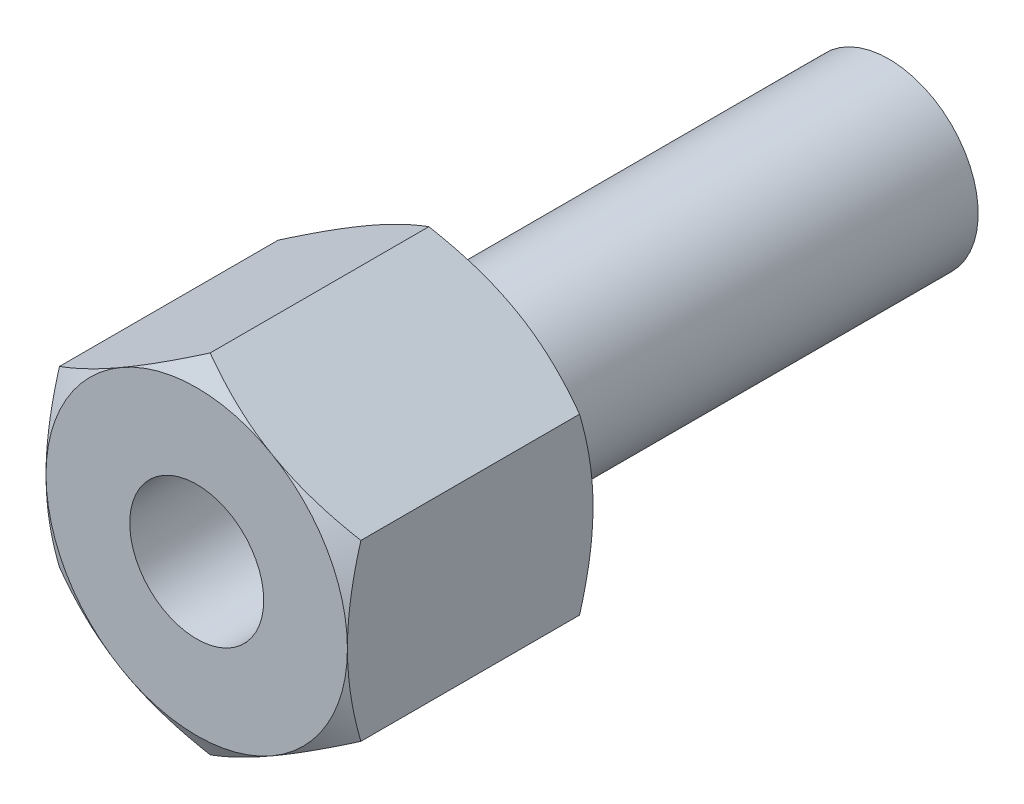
ISO-10303-21;
HEADER;
FILE_DESCRIPTION(('STEP AP214'),'2;1');
FILE_NAME('part.step','',(''),(''),'','','');
FILE_SCHEMA(('AUTOMOTIVE_DESIGN { 1 0 10303 214 1 1 1 1 }'));
ENDSEC;
DATA;
#1=APPLICATION_CONTEXT('core data for automotive mechanical design processes');
#2=APPLICATION_PROTOCOL_DEFINITION('international standard','automotive_design',2000,#1);
#3=PRODUCT_CONTEXT('',#1,'mechanical');
#4=PRODUCT('Part','Part','',(#3));
#5=PRODUCT_RELATED_PRODUCT_CATEGORY('part','',(#4));
#6=PRODUCT_DEFINITION_FORMATION('','',#4);
#7=PRODUCT_DEFINITION_CONTEXT('part definition',#1,'design');
#8=PRODUCT_DEFINITION('design','',#6,#7);
#9=PRODUCT_DEFINITION_SHAPE('','',#8);
#10=(LENGTH_UNIT() NAMED_UNIT(*) SI_UNIT(.MILLI.,.METRE.));
#11=(NAMED_UNIT(*) PLANE_ANGLE_UNIT() SI_UNIT($,.RADIAN.));
#12=(NAMED_UNIT(*) SI_UNIT($,.STERADIAN.) SOLID_ANGLE_UNIT());
#13=UNCERTAINTY_MEASURE_WITH_UNIT(LENGTH_MEASURE(1.E-05),#10,'distance_accuracy_value','');
#14=(GEOMETRIC_REPRESENTATION_CONTEXT(3) GLOBAL_UNCERTAINTY_ASSIGNED_CONTEXT((#13)) GLOBAL_UNIT_ASSIGNED_CONTEXT((#10,
#11,#12)) REPRESENTATION_CONTEXT('',''));
#15=CARTESIAN_POINT('',(0.,0.,0.));
#16=DIRECTION('',(0.,0.,1.));
#17=DIRECTION('',(1.,0.,0.));
#18=AXIS2_PLACEMENT_3D('',#15,#16,#17);
#19=CARTESIAN_POINT('',(0.,15.5884572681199,22.));
#20=DIRECTION('',(0.5,-0.866025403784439,0.));
#21=DIRECTION('',(0.866025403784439,0.5,0.));
#22=AXIS2_PLACEMENT_3D('',#19,#20,#21);
#23=PLANE('',#22);
#24=CARTESIAN_POINT('',(-13.5002,7.79411316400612,1.20583803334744));
#25=CARTESIAN_POINT('',(-13.2034751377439,7.96542734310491,1.10693600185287));
#26=CARTESIAN_POINT('',(-12.9055928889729,8.13740973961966,1.01252193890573));
#27=CARTESIAN_POINT('',(-12.3074397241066,8.48275363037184,0.833917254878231));
#28=CARTESIAN_POINT('',(-12.0071680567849,8.65611555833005,0.749729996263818));
#29=CARTESIAN_POINT('',(-11.403655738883,9.00455355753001,0.592710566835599));
#30=CARTESIAN_POINT('',(-11.1004098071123,9.17963267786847,0.519905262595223));
#31=CARTESIAN_POINT('',(-10.4918107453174,9.53100751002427,0.387213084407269));
#32=CARTESIAN_POINT('',(-10.1864577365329,9.70730315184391,0.327325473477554));
#33=CARTESIAN_POINT('',(-9.58146884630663,10.0565936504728,0.223015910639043));
#34=CARTESIAN_POINT('',(-9.28187788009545,10.2295625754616,0.17824871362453));
#35=CARTESIAN_POINT('',(-8.68132315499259,10.5762930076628,0.103183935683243));
#36=CARTESIAN_POINT('',(-8.38035936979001,10.7500545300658,0.0728866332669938));
#37=CARTESIAN_POINT('',(-7.77792621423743,11.0978694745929,0.0275266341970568));
#38=CARTESIAN_POINT('',(-7.47645787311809,11.2719223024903,0.012445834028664));
#39=CARTESIAN_POINT('',(-6.87324289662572,11.6201886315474,-0.00215683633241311));
#40=CARTESIAN_POINT('',(-6.57149627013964,11.7944021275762,-0.00167918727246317));
#41=CARTESIAN_POINT('',(-6.00738189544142,12.1200937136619,0.0137483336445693));
#42=CARTESIAN_POINT('',(-5.74497394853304,12.271595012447,0.0268164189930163));
#43=CARTESIAN_POINT('',(-5.22076165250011,12.5742491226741,0.0644725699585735));
#44=CARTESIAN_POINT('',(-4.95895734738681,12.7254019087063,0.0890614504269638));
#45=CARTESIAN_POINT('',(-4.43609453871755,13.0272768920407,0.149330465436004));
#46=CARTESIAN_POINT('',(-4.17503683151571,13.1779986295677,0.185019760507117));
#47=CARTESIAN_POINT('',(-3.65414530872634,13.4787354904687,0.266863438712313));
#48=CARTESIAN_POINT('',(-3.39431157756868,13.6287505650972,0.313018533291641));
#49=CARTESIAN_POINT('',(-2.60557180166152,14.0841296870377,0.468349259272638));
#50=CARTESIAN_POINT('',(-2.07894982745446,14.3881750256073,0.593013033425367));
#51=CARTESIAN_POINT('',(-1.03355849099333,14.9917319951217,0.875948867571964));
#52=CARTESIAN_POINT('',(-0.514775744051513,15.2912513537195,1.03415447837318));
#53=CARTESIAN_POINT('',(0.000200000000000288,15.5885727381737,1.20583803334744));
#54=B_SPLINE_CURVE_WITH_KNOTS('',3,(#24,#25,#26,#27,#28,#29,#30,#31,#32,#33,#34,#35,#36,#37,#38,
#39,#40,#41,#42,#43,#44,#45,#46,#47,#48,#49,#50,#51,#52,#53),.UNSPECIFIED.,.F.,.F.,(4,2,2,2,2,2,
2,2,2,2,2,2,2,2,4),(0.,1.0698794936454,2.14010980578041,3.21282939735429,4.28548777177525,
5.33167033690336,6.37787303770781,7.42282956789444,8.46775380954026,9.377387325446,
10.2870851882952,11.1975357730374,12.1080482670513,13.9691139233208,15.8265265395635),.UNSPECIFIED.);
#55=CARTESIAN_POINT('',(-13.5,7.79422863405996,1.20577136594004));
#56=VERTEX_POINT('',#55);
#57=CARTESIAN_POINT('',(-6.75,11.6913429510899,0.));
#58=VERTEX_POINT('',#57);
#59=EDGE_CURVE('E135',#56,#58,#54,.T.);
#60=ORIENTED_EDGE('',*,*,#59,.F.);
#61=DIRECTION('',(0.,0.,-1.));
#62=VECTOR('',#61,1.);
#63=CARTESIAN_POINT('',(-13.5,7.79422863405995,22.));
#64=LINE('',#63,#62);
#65=CARTESIAN_POINT('',(-13.5,7.79422863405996,20.79422863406));
#66=VERTEX_POINT('',#65);
#67=EDGE_CURVE('E262',#66,#56,#64,.T.);
#68=ORIENTED_EDGE('',*,*,#67,.F.);
#69=CARTESIAN_POINT('',(0.000199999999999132,15.5885727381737,20.7941619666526));
#70=CARTESIAN_POINT('',(-0.296524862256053,15.417258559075,20.8930639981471));
#71=CARTESIAN_POINT('',(-0.59440711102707,15.2452761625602,20.9874780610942));
#72=CARTESIAN_POINT('',(-1.19256027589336,14.899932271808,21.1660827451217));
#73=CARTESIAN_POINT('',(-1.49283194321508,14.7265703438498,21.2502700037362));
#74=CARTESIAN_POINT('',(-2.09634426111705,14.3781323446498,21.4072894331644));
#75=CARTESIAN_POINT('',(-2.39959019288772,14.2030532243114,21.4800947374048));
#76=CARTESIAN_POINT('',(-3.00818925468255,13.8516783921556,21.6127869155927));
#77=CARTESIAN_POINT('',(-3.31354226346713,13.675382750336,21.6726745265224));
#78=CARTESIAN_POINT('',(-3.91853115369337,13.3260922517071,21.7769840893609));
#79=CARTESIAN_POINT('',(-4.21812211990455,13.1531233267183,21.8217512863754));
#80=CARTESIAN_POINT('',(-4.81867684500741,12.8063928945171,21.8968160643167));
#81=CARTESIAN_POINT('',(-5.11964063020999,12.632631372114,21.927113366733));
#82=CARTESIAN_POINT('',(-5.72207378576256,12.284816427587,21.9724733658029));
#83=CARTESIAN_POINT('',(-6.02354212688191,12.1107635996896,21.9875541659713));
#84=CARTESIAN_POINT('',(-6.62675710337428,11.7624972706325,22.0021568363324));
#85=CARTESIAN_POINT('',(-6.92850372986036,11.5882837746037,22.0016791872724));
#86=CARTESIAN_POINT('',(-7.49261810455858,11.262592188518,21.9862516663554));
#87=CARTESIAN_POINT('',(-7.75502605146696,11.1110908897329,21.973183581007));
#88=CARTESIAN_POINT('',(-8.27923834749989,10.8084367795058,21.9355274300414));
#89=CARTESIAN_POINT('',(-8.54104265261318,10.6572839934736,21.910938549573));
#90=CARTESIAN_POINT('',(-9.06390546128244,10.3554090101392,21.850669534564));
#91=CARTESIAN_POINT('',(-9.32496316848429,10.2046872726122,21.8149802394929));
#92=CARTESIAN_POINT('',(-9.84585469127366,9.90395041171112,21.7331365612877));
#93=CARTESIAN_POINT('',(-10.1056884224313,9.7539353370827,21.6869814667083));
#94=CARTESIAN_POINT('',(-10.8944281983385,9.29855621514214,21.5316507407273));
#95=CARTESIAN_POINT('',(-11.4210501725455,8.99451087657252,21.4069869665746));
#96=CARTESIAN_POINT('',(-12.4664415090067,8.39095390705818,21.124051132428));
#97=CARTESIAN_POINT('',(-12.9852242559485,8.09143454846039,20.9658455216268));
#98=CARTESIAN_POINT('',(-13.5002,7.79411316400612,20.7941619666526));
#99=B_SPLINE_CURVE_WITH_KNOTS('',3,(#69,#70,#71,#72,#73,#74,#75,#76,#77,#78,#79,#80,#81,#82,#83,
#84,#85,#86,#87,#88,#89,#90,#91,#92,#93,#94,#95,#96,#97,#98),.UNSPECIFIED.,.F.,.F.,(4,2,2,2,2,2,
2,2,2,2,2,2,2,2,4),(0.,1.0698794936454,2.14010980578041,3.21282939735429,4.28548777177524,
5.33167033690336,6.37787303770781,7.42282956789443,8.46775380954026,9.37738732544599,
10.2870851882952,11.1975357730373,12.1080482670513,13.9691139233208,15.8265265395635),.UNSPECIFIED.);
#100=CARTESIAN_POINT('',(-6.75,11.6913429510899,22.));
#101=VERTEX_POINT('',#100);
#102=EDGE_CURVE('E197',#101,#66,#99,.T.);
#103=ORIENTED_EDGE('',*,*,#102,.F.);
#104=CARTESIAN_POINT('',(0.,15.5884572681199,20.79422863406));
#105=VERTEX_POINT('',#104);
#106=EDGE_CURVE('E225',#105,#101,#99,.T.);
#107=ORIENTED_EDGE('',*,*,#106,.F.);
#108=DIRECTION('',(0.,0.,-1.));
#109=VECTOR('',#108,1.);
#110=CARTESIAN_POINT('',(0.,15.5884572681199,22.));
#111=LINE('',#110,#109);
#112=CARTESIAN_POINT('',(0.,15.5884572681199,1.20577136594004));
#113=VERTEX_POINT('',#112);
#114=EDGE_CURVE('E251',#105,#113,#111,.T.);
#115=ORIENTED_EDGE('',*,*,#114,.T.);
#116=EDGE_CURVE('E128',#58,#113,#54,.T.);
#117=ORIENTED_EDGE('',*,*,#116,.F.);
#118=EDGE_LOOP('',(#60,#68,#103,#107,#115,#117));
#119=FACE_BOUND('',#118,.T.);
#120=ADVANCED_FACE('F14',(#119),#23,.F.);
#121=CARTESIAN_POINT('',(-13.5,7.79422863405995,22.));
#122=DIRECTION('',(1.,0.,0.));
#123=DIRECTION('',(0.,0.,-1.));
#124=AXIS2_PLACEMENT_3D('',#121,#122,#123);
#125=PLANE('',#124);
#126=CARTESIAN_POINT('',(-13.5,-20.9690515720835,6.60427966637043));
#127=CARTESIAN_POINT('',(-13.5,-20.6741137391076,6.46110640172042));
#128=CARTESIAN_POINT('',(-13.5,-20.3788307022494,6.31864459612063));
#129=CARTESIAN_POINT('',(-13.5,-19.7875021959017,6.03530496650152));
#130=CARTESIAN_POINT('',(-13.5,-19.4914567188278,5.89442715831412));
#131=CARTESIAN_POINT('',(-13.5,-18.6019902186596,5.47437441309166));
#132=CARTESIAN_POINT('',(-13.5,-18.0073258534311,5.19782237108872));
#133=CARTESIAN_POINT('',(-13.5,-16.8108081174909,4.65189671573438));
#134=CARTESIAN_POINT('',(-13.5,-16.2089332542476,4.38257009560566));
#135=CARTESIAN_POINT('',(-13.5,-15.0004086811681,3.8548900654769));
#136=CARTESIAN_POINT('',(-13.5,-14.3937591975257,3.5965361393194));
#137=CARTESIAN_POINT('',(-13.5,-13.154985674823,3.08556371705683));
#138=CARTESIAN_POINT('',(-13.5,-12.5226725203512,2.83340132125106));
#139=CARTESIAN_POINT('',(-13.5,-11.2506561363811,2.34808086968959));
#140=CARTESIAN_POINT('',(-13.5,-10.6109520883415,2.11492494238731));
#141=CARTESIAN_POINT('',(-13.5,-9.3243438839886,1.67371788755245));
#142=CARTESIAN_POINT('',(-13.5,-8.67745720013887,1.46561621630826));
#143=CARTESIAN_POINT('',(-13.5,-7.3743430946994,1.08116194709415));
#144=CARTESIAN_POINT('',(-13.5,-6.71811867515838,0.904799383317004));
#145=CARTESIAN_POINT('',(-13.5,-5.72848508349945,0.670909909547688));
#146=CARTESIAN_POINT('',(-13.5,-5.39863937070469,0.598214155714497));
#147=CARTESIAN_POINT('',(-13.5,-4.73668801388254,0.463902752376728));
#148=CARTESIAN_POINT('',(-13.5,-4.40458241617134,0.402286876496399));
#149=CARTESIAN_POINT('',(-13.5,-3.73833764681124,0.291220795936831));
#150=CARTESIAN_POINT('',(-13.5,-3.40419850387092,0.241770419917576));
#151=CARTESIAN_POINT('',(-13.5,-2.73423832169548,0.156020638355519));
#152=CARTESIAN_POINT('',(-13.5,-2.39841734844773,0.119720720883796));
#153=CARTESIAN_POINT('',(-13.5,-1.72996129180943,0.0614498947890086));
#154=CARTESIAN_POINT('',(-13.5,-1.39734213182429,0.039297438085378));
#155=CARTESIAN_POINT('',(-13.5,-0.731465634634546,0.00908025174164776));
#156=CARTESIAN_POINT('',(-13.5,-0.398208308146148,0.00101528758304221));
#157=CARTESIAN_POINT('',(-13.5,0.268349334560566,-0.000834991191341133));
#158=CARTESIAN_POINT('',(-13.5,0.601649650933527,0.00537974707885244));
#159=CARTESIAN_POINT('',(-13.5,1.26769084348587,0.0319369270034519));
#160=CARTESIAN_POINT('',(-13.5,1.6004316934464,0.0522800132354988));
#161=CARTESIAN_POINT('',(-13.5,2.3991294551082,0.117635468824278));
#162=CARTESIAN_POINT('',(-13.5,2.86455194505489,0.169296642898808));
#163=CARTESIAN_POINT('',(-13.5,3.79196698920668,0.297455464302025));
#164=CARTESIAN_POINT('',(-13.5,4.25395907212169,0.373956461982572));
#165=CARTESIAN_POINT('',(-13.5,5.17406501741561,0.549073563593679));
#166=CARTESIAN_POINT('',(-13.5,5.63217557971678,0.6477068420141));
#167=CARTESIAN_POINT('',(-13.5,6.54381301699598,0.864076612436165));
#168=CARTESIAN_POINT('',(-13.5,6.99733995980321,0.98181282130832));
#169=CARTESIAN_POINT('',(-13.5,7.90978036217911,1.23630321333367));
#170=CARTESIAN_POINT('',(-13.5,8.36859213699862,1.3734194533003));
#171=CARTESIAN_POINT('',(-13.5,9.2816964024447,1.66187769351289));
#172=CARTESIAN_POINT('',(-13.5,9.73598886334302,1.81321978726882));
#173=CARTESIAN_POINT('',(-13.5,10.6402777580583,2.12772164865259));
#174=CARTESIAN_POINT('',(-13.5,11.0902755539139,2.29087751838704));
#175=CARTESIAN_POINT('',(-13.5,11.9865386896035,2.62708173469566));
#176=CARTESIAN_POINT('',(-13.5,12.4328040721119,2.80012996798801));
#177=CARTESIAN_POINT('',(-13.5,13.4814301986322,3.2180020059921));
#178=CARTESIAN_POINT('',(-13.5,14.0823974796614,3.46631724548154));
#179=CARTESIAN_POINT('',(-13.5,15.2792424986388,3.97495918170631));
#180=CARTESIAN_POINT('',(-13.5,15.8751199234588,4.23528661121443));
#181=CARTESIAN_POINT('',(-13.5,17.0627263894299,4.7655608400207));
#182=CARTESIAN_POINT('',(-13.5,17.6544544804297,5.03550976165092));
#183=CARTESIAN_POINT('',(-13.5,18.834318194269,5.5830964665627));
#184=CARTESIAN_POINT('',(-13.5,19.4224538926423,5.86073408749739));
#185=CARTESIAN_POINT('',(-13.5,20.5963639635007,6.42257322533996));
#186=CARTESIAN_POINT('',(-13.5,21.1821350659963,6.70678156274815));
#187=CARTESIAN_POINT('',(-13.5,22.3511480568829,7.28035211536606));
#188=CARTESIAN_POINT('',(-13.5,22.934389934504,7.56971435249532));
#189=CARTESIAN_POINT('',(-13.5,24.0986566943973,8.15267567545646));
#190=CARTESIAN_POINT('',(-13.5,24.6796818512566,8.44627421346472));
#191=CARTESIAN_POINT('',(-13.5,25.839908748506,9.0370542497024));
#192=CARTESIAN_POINT('',(-13.5,26.4191104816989,9.3342357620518));
#193=CARTESIAN_POINT('',(-13.5,28.0579122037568,10.1804827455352));
#194=CARTESIAN_POINT('',(-13.5,29.1156763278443,10.733103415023));
#195=CARTESIAN_POINT('',(-13.5,31.2272519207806,11.8459167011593));
#196=CARTESIAN_POINT('',(-13.5,32.2810632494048,12.4061095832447));
#197=CARTESIAN_POINT('',(-13.5,34.3829660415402,13.5308984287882));
#198=CARTESIAN_POINT('',(-13.5,35.4310652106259,14.0954800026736));
#199=CARTESIAN_POINT('',(-13.5,37.0013470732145,14.9457277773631));
#200=CARTESIAN_POINT('',(-13.5,37.5244491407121,15.2296985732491));
#201=CARTESIAN_POINT('',(-13.5,38.5701011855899,15.7986529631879));
#202=CARTESIAN_POINT('',(-13.5,39.0926511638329,16.0836365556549));
#203=CARTESIAN_POINT('',(-13.5,39.6149562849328,16.3690683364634));
#204=B_SPLINE_CURVE_WITH_KNOTS('',3,(#126,#127,#128,#129,#130,#131,#132,#133,#134,#135,#136,
#137,#138,#139,#140,#141,#142,#143,#144,#145,#146,#147,#148,#149,#150,#151,#152,#153,#154,#155,
#156,#157,#158,#159,#160,#161,#162,#163,#164,#165,#166,#167,#168,#169,#170,#171,#172,#173,#174,
#175,#176,#177,#178,#179,#180,#181,#182,#183,#184,#185,#186,#187,#188,#189,#190,#191,#192,#193,
#194,#195,#196,#197,#198,#199,#200,#201,#202,#203),.UNSPECIFIED.,.F.,.F.,(4,2,2,2,2,2,2,2,2,2,2,
2,2,2,2,2,2,2,2,2,2,2,2,2,2,2,2,2,2,2,2,2,2,2,2,2,2,2,4),(0.,0.983554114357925,1.96711805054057,
3.9345352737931,5.91260855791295,7.89058868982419,9.93257285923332,11.9747853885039,
14.0128064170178,16.0501864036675,17.0633150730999,18.0764230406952,19.0895167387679,
20.1025709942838,21.1023491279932,22.1021106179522,23.1018758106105,24.1016866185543,
25.5057530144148,26.9100088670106,28.3153582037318,29.7206867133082,31.1569980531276,
32.5933188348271,34.0291678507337,35.4650004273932,37.4155668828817,39.3662524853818,
41.3173710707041,43.2684484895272,45.2216511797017,47.1748621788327,49.1278228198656,
51.0807911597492,54.6610088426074,58.2413523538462,61.8128043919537,63.59843417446,
65.3840611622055),.UNSPECIFIED.);
#205=CARTESIAN_POINT('',(-13.5,-7.79422863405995,1.20577136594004));
#206=VERTEX_POINT('',#205);
#207=CARTESIAN_POINT('',(-13.5,0.,0.));
#208=VERTEX_POINT('',#207);
#209=EDGE_CURVE('E333',#206,#208,#204,.T.);
#210=ORIENTED_EDGE('',*,*,#209,.F.);
#211=DIRECTION('',(0.,0.,-1.));
#212=VECTOR('',#211,1.);
#213=CARTESIAN_POINT('',(-13.5,-7.79422863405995,22.));
#214=LINE('',#213,#212);
#215=CARTESIAN_POINT('',(-13.5,-7.79422863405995,20.79422863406));
#216=VERTEX_POINT('',#215);
#217=EDGE_CURVE('E265',#216,#206,#214,.T.);
#218=ORIENTED_EDGE('',*,*,#217,.F.);
#219=CARTESIAN_POINT('',(-13.5,-20.9690515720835,15.3957203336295));
#220=CARTESIAN_POINT('',(-13.5,-20.6741137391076,15.5388935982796));
#221=CARTESIAN_POINT('',(-13.5,-20.3788307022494,15.6813554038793));
#222=CARTESIAN_POINT('',(-13.5,-19.7875021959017,15.9646950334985));
#223=CARTESIAN_POINT('',(-13.5,-19.4914567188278,16.1055728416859));
#224=CARTESIAN_POINT('',(-13.5,-18.6019902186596,16.5256255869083));
#225=CARTESIAN_POINT('',(-13.5,-18.0073258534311,16.8021776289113));
#226=CARTESIAN_POINT('',(-13.5,-16.8108081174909,17.3481032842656));
#227=CARTESIAN_POINT('',(-13.5,-16.2089332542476,17.6174299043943));
#228=CARTESIAN_POINT('',(-13.5,-15.0004086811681,18.1451099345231));
#229=CARTESIAN_POINT('',(-13.5,-14.3937591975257,18.4034638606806));
#230=CARTESIAN_POINT('',(-13.5,-13.1549856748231,18.9144362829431));
#231=CARTESIAN_POINT('',(-13.5,-12.5226725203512,19.1665986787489));
#232=CARTESIAN_POINT('',(-13.5,-11.2506561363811,19.6519191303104));
#233=CARTESIAN_POINT('',(-13.5,-10.6109520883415,19.8850750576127));
#234=CARTESIAN_POINT('',(-13.5,-9.32434388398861,20.3262821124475));
#235=CARTESIAN_POINT('',(-13.5,-8.67745720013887,20.5343837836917));
#236=CARTESIAN_POINT('',(-13.5,-7.3743430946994,20.9188380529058));
#237=CARTESIAN_POINT('',(-13.5,-6.71811867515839,21.095200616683));
#238=CARTESIAN_POINT('',(-13.5,-5.72848508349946,21.3290900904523));
#239=CARTESIAN_POINT('',(-13.5,-5.39863937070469,21.4017858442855));
#240=CARTESIAN_POINT('',(-13.5,-4.73668801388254,21.5360972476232));
#241=CARTESIAN_POINT('',(-13.5,-4.40458241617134,21.5977131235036));
#242=CARTESIAN_POINT('',(-13.5,-3.73833764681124,21.7087792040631));
#243=CARTESIAN_POINT('',(-13.5,-3.40419850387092,21.7582295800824));
#244=CARTESIAN_POINT('',(-13.5,-2.73423832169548,21.8439793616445));
#245=CARTESIAN_POINT('',(-13.5,-2.39841734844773,21.8802792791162));
#246=CARTESIAN_POINT('',(-13.5,-1.72996129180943,21.938550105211));
#247=CARTESIAN_POINT('',(-13.5,-1.39734213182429,21.9607025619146));
#248=CARTESIAN_POINT('',(-13.5,-0.731465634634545,21.9909197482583));
#249=CARTESIAN_POINT('',(-13.5,-0.398208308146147,21.9989847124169));
#250=CARTESIAN_POINT('',(-13.5,0.268349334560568,22.0008349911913));
#251=CARTESIAN_POINT('',(-13.5,0.601649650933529,21.9946202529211));
#252=CARTESIAN_POINT('',(-13.5,1.26769084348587,21.9680630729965));
#253=CARTESIAN_POINT('',(-13.5,1.6004316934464,21.9477199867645));
#254=CARTESIAN_POINT('',(-13.5,2.3991294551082,21.8823645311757));
#255=CARTESIAN_POINT('',(-13.5,2.86455194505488,21.8307033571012));
#256=CARTESIAN_POINT('',(-13.5,3.79196698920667,21.7025445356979));
#257=CARTESIAN_POINT('',(-13.5,4.25395907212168,21.6260435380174));
#258=CARTESIAN_POINT('',(-13.5,5.1740650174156,21.4509264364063));
#259=CARTESIAN_POINT('',(-13.5,5.63217557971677,21.3522931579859));
#260=CARTESIAN_POINT('',(-13.5,6.54381301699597,21.1359233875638));
#261=CARTESIAN_POINT('',(-13.5,6.9973399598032,21.0181871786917));
#262=CARTESIAN_POINT('',(-13.5,7.90978036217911,20.7636967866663));
#263=CARTESIAN_POINT('',(-13.5,8.36859213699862,20.6265805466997));
#264=CARTESIAN_POINT('',(-13.5,9.2816964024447,20.3381223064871));
#265=CARTESIAN_POINT('',(-13.5,9.73598886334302,20.1867802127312));
#266=CARTESIAN_POINT('',(-13.5,10.6402777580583,19.8722783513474));
#267=CARTESIAN_POINT('',(-13.5,11.0902755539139,19.7091224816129));
#268=CARTESIAN_POINT('',(-13.5,11.9865386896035,19.3729182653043));
#269=CARTESIAN_POINT('',(-13.5,12.4328040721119,19.199870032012));
#270=CARTESIAN_POINT('',(-13.5,13.4814301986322,18.7819979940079));
#271=CARTESIAN_POINT('',(-13.5,14.0823974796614,18.5336827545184));
#272=CARTESIAN_POINT('',(-13.5,15.2792424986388,18.0250408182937));
#273=CARTESIAN_POINT('',(-13.5,15.8751199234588,17.7647133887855));
#274=CARTESIAN_POINT('',(-13.5,17.0627263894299,17.2344391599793));
#275=CARTESIAN_POINT('',(-13.5,17.6544544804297,16.9644902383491));
#276=CARTESIAN_POINT('',(-13.5,18.834318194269,16.4169035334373));
#277=CARTESIAN_POINT('',(-13.5,19.4224538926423,16.1392659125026));
#278=CARTESIAN_POINT('',(-13.5,20.5963639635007,15.57742677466));
#279=CARTESIAN_POINT('',(-13.5,21.1821350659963,15.2932184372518));
#280=CARTESIAN_POINT('',(-13.5,22.3511480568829,14.7196478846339));
#281=CARTESIAN_POINT('',(-13.5,22.934389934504,14.4302856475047));
#282=CARTESIAN_POINT('',(-13.5,24.0986566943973,13.8473243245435));
#283=CARTESIAN_POINT('',(-13.5,24.6796818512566,13.5537257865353));
#284=CARTESIAN_POINT('',(-13.5,25.839908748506,12.9629457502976));
#285=CARTESIAN_POINT('',(-13.5,26.4191104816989,12.6657642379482));
#286=CARTESIAN_POINT('',(-13.5,28.0579122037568,11.8195172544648));
#287=CARTESIAN_POINT('',(-13.5,29.1156763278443,11.266896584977));
#288=CARTESIAN_POINT('',(-13.5,31.2272519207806,10.1540832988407));
#289=CARTESIAN_POINT('',(-13.5,32.2810632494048,9.59389041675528));
#290=CARTESIAN_POINT('',(-13.5,34.3829660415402,8.46910157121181));
#291=CARTESIAN_POINT('',(-13.5,35.4310652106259,7.90451999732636));
#292=CARTESIAN_POINT('',(-13.5,37.0013470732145,7.05427222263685));
#293=CARTESIAN_POINT('',(-13.5,37.5244491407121,6.7703014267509));
#294=CARTESIAN_POINT('',(-13.5,38.5701011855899,6.20134703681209));
#295=CARTESIAN_POINT('',(-13.5,39.0926511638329,5.91636344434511));
#296=CARTESIAN_POINT('',(-13.5,39.6149562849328,5.63093166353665));
#297=B_SPLINE_CURVE_WITH_KNOTS('',3,(#219,#220,#221,#222,#223,#224,#225,#226,#227,#228,#229,
#230,#231,#232,#233,#234,#235,#236,#237,#238,#239,#240,#241,#242,#243,#244,#245,#246,#247,#248,
#249,#250,#251,#252,#253,#254,#255,#256,#257,#258,#259,#260,#261,#262,#263,#264,#265,#266,#267,
#268,#269,#270,#271,#272,#273,#274,#275,#276,#277,#278,#279,#280,#281,#282,#283,#284,#285,#286,
#287,#288,#289,#290,#291,#292,#293,#294,#295,#296),.UNSPECIFIED.,.F.,.F.,(4,2,2,2,2,2,2,2,2,2,2,
2,2,2,2,2,2,2,2,2,2,2,2,2,2,2,2,2,2,2,2,2,2,2,2,2,2,2,4),(0.,0.983554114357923,1.96711805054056,
3.93453527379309,5.91260855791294,7.89058868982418,9.93257285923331,11.9747853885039,
14.0128064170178,16.0501864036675,17.0633150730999,18.0764230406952,19.0895167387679,
20.1025709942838,21.1023491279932,22.1021106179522,23.1018758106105,24.1016866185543,
25.5057530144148,26.9100088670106,28.3153582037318,29.7206867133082,31.1569980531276,
32.5933188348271,34.0291678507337,35.4650004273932,37.4155668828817,39.3662524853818,
41.3173710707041,43.2684484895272,45.2216511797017,47.1748621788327,49.1278228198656,
51.0807911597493,54.6610088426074,58.2413523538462,61.8128043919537,63.59843417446,
65.3840611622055),.UNSPECIFIED.);
#298=CARTESIAN_POINT('',(-13.5,0.,22.));
#299=VERTEX_POINT('',#298);
#300=EDGE_CURVE('E224',#299,#216,#297,.F.);
#301=ORIENTED_EDGE('',*,*,#300,.F.);
#302=EDGE_CURVE('E206',#66,#299,#297,.F.);
#303=ORIENTED_EDGE('',*,*,#302,.F.);
#304=ORIENTED_EDGE('',*,*,#67,.T.);
#305=EDGE_CURVE('E304',#208,#56,#204,.T.);
#306=ORIENTED_EDGE('',*,*,#305,.F.);
#307=EDGE_LOOP('',(#210,#218,#301,#303,#304,#306));
#308=FACE_BOUND('',#307,.T.);
#309=ADVANCED_FACE('F311',(#308),#125,.F.);
#310=CARTESIAN_POINT('',(-13.5,-7.79422863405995,22.));
#311=DIRECTION('',(0.5,0.866025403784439,0.));
#312=DIRECTION('',(-0.866025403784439,0.5,0.));
#313=AXIS2_PLACEMENT_3D('',#310,#311,#312);
#314=PLANE('',#313);
#315=CARTESIAN_POINT('',(0.000199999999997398,-15.5885727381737,1.20583803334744));
#316=CARTESIAN_POINT('',(-0.296524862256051,-15.417258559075,1.10693600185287));
#317=CARTESIAN_POINT('',(-0.594407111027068,-15.2452761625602,1.01252193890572));
#318=CARTESIAN_POINT('',(-1.19256027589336,-14.899932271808,0.833917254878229));
#319=CARTESIAN_POINT('',(-1.49283194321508,-14.7265703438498,0.749729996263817));
#320=CARTESIAN_POINT('',(-2.09634426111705,-14.3781323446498,0.592710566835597));
#321=CARTESIAN_POINT('',(-2.39959019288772,-14.2030532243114,0.519905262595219));
#322=CARTESIAN_POINT('',(-3.00818925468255,-13.8516783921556,0.387213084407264));
#323=CARTESIAN_POINT('',(-3.31354226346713,-13.6753827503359,0.327325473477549));
#324=CARTESIAN_POINT('',(-3.91853115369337,-13.3260922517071,0.223015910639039));
#325=CARTESIAN_POINT('',(-4.21812211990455,-13.1531233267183,0.178248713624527));
#326=CARTESIAN_POINT('',(-4.81867684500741,-12.8063928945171,0.10318393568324));
#327=CARTESIAN_POINT('',(-5.11964063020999,-12.632631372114,0.0728866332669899));
#328=CARTESIAN_POINT('',(-5.72207378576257,-12.284816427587,0.0275266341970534));
#329=CARTESIAN_POINT('',(-6.02354212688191,-12.1107635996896,0.0124458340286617));
#330=CARTESIAN_POINT('',(-6.62675710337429,-11.7624972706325,-0.00215683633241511));
#331=CARTESIAN_POINT('',(-6.92850372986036,-11.5882837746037,-0.00167918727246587));
#332=CARTESIAN_POINT('',(-7.49261810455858,-11.2625921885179,0.0137483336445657));
#333=CARTESIAN_POINT('',(-7.75502605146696,-11.1110908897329,0.0268164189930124));
#334=CARTESIAN_POINT('',(-8.2792383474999,-10.8084367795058,0.0644725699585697));
#335=CARTESIAN_POINT('',(-8.54104265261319,-10.6572839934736,0.0890614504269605));
#336=CARTESIAN_POINT('',(-9.06390546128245,-10.3554090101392,0.149330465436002));
#337=CARTESIAN_POINT('',(-9.3249631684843,-10.2046872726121,0.185019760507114));
#338=CARTESIAN_POINT('',(-9.84585469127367,-9.90395041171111,0.26686343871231));
#339=CARTESIAN_POINT('',(-10.1056884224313,-9.75393533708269,0.313018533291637));
#340=CARTESIAN_POINT('',(-10.8944281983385,-9.29855621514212,0.468349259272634));
#341=CARTESIAN_POINT('',(-11.4210501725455,-8.99451087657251,0.593013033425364));
#342=CARTESIAN_POINT('',(-12.4664415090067,-8.39095390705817,0.875948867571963));
#343=CARTESIAN_POINT('',(-12.9852242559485,-8.09143454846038,1.03415447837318));
#344=CARTESIAN_POINT('',(-13.5002,-7.79411316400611,1.20583803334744));
#345=B_SPLINE_CURVE_WITH_KNOTS('',3,(#315,#316,#317,#318,#319,#320,#321,#322,#323,#324,#325,
#326,#327,#328,#329,#330,#331,#332,#333,#334,#335,#336,#337,#338,#339,#340,#341,#342,#343,#344),
.UNSPECIFIED.,.F.,.F.,(4,2,2,2,2,2,2,2,2,2,2,2,2,2,4),(0.,1.06987949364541,2.14010980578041,
3.21282939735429,4.28548777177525,5.33167033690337,6.37787303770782,7.42282956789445,
8.46775380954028,9.377387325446,10.2870851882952,11.1975357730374,12.1080482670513,
13.9691139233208,15.8265265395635),.UNSPECIFIED.);
#346=CARTESIAN_POINT('',(0.,-15.5884572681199,1.20577136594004));
#347=VERTEX_POINT('',#346);
#348=CARTESIAN_POINT('',(-6.75,-11.6913429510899,0.));
#349=VERTEX_POINT('',#348);
#350=EDGE_CURVE('E294',#347,#349,#345,.T.);
#351=ORIENTED_EDGE('',*,*,#350,.F.);
#352=DIRECTION('',(0.,0.,-1.));
#353=VECTOR('',#352,1.);
#354=CARTESIAN_POINT('',(0.,-15.5884572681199,22.));
#355=LINE('',#354,#353);
#356=CARTESIAN_POINT('',(0.,-15.5884572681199,20.79422863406));
#357=VERTEX_POINT('',#356);
#358=EDGE_CURVE('E270',#357,#347,#355,.T.);
#359=ORIENTED_EDGE('',*,*,#358,.F.);
#360=CARTESIAN_POINT('',(-13.5002,-7.79411316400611,20.7941619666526));
#361=CARTESIAN_POINT('',(-13.2034751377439,-7.9654273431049,20.8930639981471));
#362=CARTESIAN_POINT('',(-12.9055928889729,-8.13740973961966,20.9874780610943));
#363=CARTESIAN_POINT('',(-12.3074397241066,-8.48275363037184,21.1660827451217));
#364=CARTESIAN_POINT('',(-12.0071680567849,-8.65611555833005,21.2502700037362));
#365=CARTESIAN_POINT('',(-11.403655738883,-9.00455355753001,21.4072894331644));
#366=CARTESIAN_POINT('',(-11.1004098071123,-9.17963267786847,21.4800947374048));
#367=CARTESIAN_POINT('',(-10.4918107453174,-9.53100751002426,21.6127869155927));
#368=CARTESIAN_POINT('',(-10.1864577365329,-9.7073031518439,21.6726745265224));
#369=CARTESIAN_POINT('',(-9.58146884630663,-10.0565936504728,21.7769840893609));
#370=CARTESIAN_POINT('',(-9.28187788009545,-10.2295625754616,21.8217512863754));
#371=CARTESIAN_POINT('',(-8.68132315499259,-10.5762930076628,21.8968160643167));
#372=CARTESIAN_POINT('',(-8.38035936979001,-10.7500545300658,21.927113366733));
#373=CARTESIAN_POINT('',(-7.77792621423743,-11.0978694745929,21.9724733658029));
#374=CARTESIAN_POINT('',(-7.47645787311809,-11.2719223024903,21.9875541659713));
#375=CARTESIAN_POINT('',(-6.87324289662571,-11.6201886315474,22.0021568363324));
#376=CARTESIAN_POINT('',(-6.57149627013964,-11.7944021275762,22.0016791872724));
#377=CARTESIAN_POINT('',(-6.00738189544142,-12.1200937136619,21.9862516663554));
#378=CARTESIAN_POINT('',(-5.74497394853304,-12.271595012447,21.973183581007));
#379=CARTESIAN_POINT('',(-5.22076165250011,-12.5742491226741,21.9355274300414));
#380=CARTESIAN_POINT('',(-4.95895734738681,-12.7254019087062,21.910938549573));
#381=CARTESIAN_POINT('',(-4.43609453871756,-13.0272768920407,21.850669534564));
#382=CARTESIAN_POINT('',(-4.17503683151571,-13.1779986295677,21.8149802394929));
#383=CARTESIAN_POINT('',(-3.65414530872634,-13.4787354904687,21.7331365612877));
#384=CARTESIAN_POINT('',(-3.39431157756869,-13.6287505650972,21.6869814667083));
#385=CARTESIAN_POINT('',(-2.60557180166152,-14.0841296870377,21.5316507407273));
#386=CARTESIAN_POINT('',(-2.07894982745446,-14.3881750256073,21.4069869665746));
#387=CARTESIAN_POINT('',(-1.03355849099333,-14.9917319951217,21.124051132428));
#388=CARTESIAN_POINT('',(-0.514775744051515,-15.2912513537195,20.9658455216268));
#389=CARTESIAN_POINT('',(0.000199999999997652,-15.5885727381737,20.7941619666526));
#390=B_SPLINE_CURVE_WITH_KNOTS('',3,(#360,#361,#362,#363,#364,#365,#366,#367,#368,#369,#370,
#371,#372,#373,#374,#375,#376,#377,#378,#379,#380,#381,#382,#383,#384,#385,#386,#387,#388,#389),
.UNSPECIFIED.,.F.,.F.,(4,2,2,2,2,2,2,2,2,2,2,2,2,2,4),(0.,1.0698794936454,2.14010980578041,
3.21282939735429,4.28548777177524,5.33167033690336,6.37787303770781,7.42282956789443,
8.46775380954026,9.37738732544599,10.2870851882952,11.1975357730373,12.1080482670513,
13.9691139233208,15.8265265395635),.UNSPECIFIED.);
#391=CARTESIAN_POINT('',(-6.75,-11.6913429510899,22.));
#392=VERTEX_POINT('',#391);
#393=EDGE_CURVE('E233',#392,#357,#390,.T.);
#394=ORIENTED_EDGE('',*,*,#393,.F.);
#395=EDGE_CURVE('E172',#216,#392,#390,.T.);
#396=ORIENTED_EDGE('',*,*,#395,.F.);
#397=ORIENTED_EDGE('',*,*,#217,.T.);
#398=EDGE_CURVE('E295',#349,#206,#345,.T.);
#399=ORIENTED_EDGE('',*,*,#398,.F.);
#400=EDGE_LOOP('',(#351,#359,#394,#396,#397,#399));
#401=FACE_BOUND('',#400,.T.);
#402=ADVANCED_FACE('F291',(#401),#314,.F.);
#403=CARTESIAN_POINT('',(0.,-15.5884572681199,22.));
#404=DIRECTION('',(-0.5,0.866025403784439,0.));
#405=DIRECTION('',(-0.866025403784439,-0.5,0.));
#406=AXIS2_PLACEMENT_3D('',#403,#404,#405);
#407=PLANE('',#406);
#408=CARTESIAN_POINT('',(13.5002,-7.79411316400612,1.20583803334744));
#409=CARTESIAN_POINT('',(13.2034751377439,-7.96542734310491,1.10693600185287));
#410=CARTESIAN_POINT('',(12.9055928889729,-8.13740973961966,1.01252193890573));
#411=CARTESIAN_POINT('',(12.3074397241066,-8.48275363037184,0.83391725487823));
#412=CARTESIAN_POINT('',(12.0071680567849,-8.65611555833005,0.749729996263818));
#413=CARTESIAN_POINT('',(11.403655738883,-9.00455355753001,0.5927105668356));
#414=CARTESIAN_POINT('',(11.1004098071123,-9.17963267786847,0.519905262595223));
#415=CARTESIAN_POINT('',(10.4918107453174,-9.53100751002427,0.387213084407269));
#416=CARTESIAN_POINT('',(10.1864577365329,-9.70730315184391,0.327325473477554));
#417=CARTESIAN_POINT('',(9.58146884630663,-10.0565936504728,0.223015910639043));
#418=CARTESIAN_POINT('',(9.28187788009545,-10.2295625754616,0.17824871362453));
#419=CARTESIAN_POINT('',(8.68132315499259,-10.5762930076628,0.103183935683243));
#420=CARTESIAN_POINT('',(8.38035936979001,-10.7500545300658,0.0728866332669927));
#421=CARTESIAN_POINT('',(7.77792621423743,-11.0978694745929,0.0275266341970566));
#422=CARTESIAN_POINT('',(7.47645787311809,-11.2719223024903,0.0124458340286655));
#423=CARTESIAN_POINT('',(6.87324289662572,-11.6201886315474,-0.00215683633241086));
#424=CARTESIAN_POINT('',(6.57149627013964,-11.7944021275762,-0.00167918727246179));
#425=CARTESIAN_POINT('',(6.00738189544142,-12.1200937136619,0.0137483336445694));
#426=CARTESIAN_POINT('',(5.74497394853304,-12.271595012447,0.0268164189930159));
#427=CARTESIAN_POINT('',(5.22076165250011,-12.5742491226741,0.0644725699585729));
#428=CARTESIAN_POINT('',(4.95895734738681,-12.7254019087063,0.0890614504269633));
#429=CARTESIAN_POINT('',(4.43609453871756,-13.0272768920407,0.149330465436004));
#430=CARTESIAN_POINT('',(4.17503683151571,-13.1779986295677,0.185019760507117));
#431=CARTESIAN_POINT('',(3.65414530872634,-13.4787354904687,0.266863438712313));
#432=CARTESIAN_POINT('',(3.39431157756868,-13.6287505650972,0.313018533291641));
#433=CARTESIAN_POINT('',(2.60557180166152,-14.0841296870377,0.468349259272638));
#434=CARTESIAN_POINT('',(2.07894982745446,-14.3881750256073,0.593013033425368));
#435=CARTESIAN_POINT('',(1.03355849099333,-14.9917319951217,0.875948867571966));
#436=CARTESIAN_POINT('',(0.51477574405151,-15.2912513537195,1.03415447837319));
#437=CARTESIAN_POINT('',(-0.000200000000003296,-15.5885727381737,1.20583803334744));
#438=B_SPLINE_CURVE_WITH_KNOTS('',3,(#408,#409,#410,#411,#412,#413,#414,#415,#416,#417,#418,
#419,#420,#421,#422,#423,#424,#425,#426,#427,#428,#429,#430,#431,#432,#433,#434,#435,#436,#437),
.UNSPECIFIED.,.F.,.F.,(4,2,2,2,2,2,2,2,2,2,2,2,2,2,4),(0.,1.0698794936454,2.14010980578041,
3.21282939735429,4.28548777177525,5.33167033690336,6.37787303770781,7.42282956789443,
8.46775380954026,9.37738732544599,10.2870851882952,11.1975357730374,12.1080482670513,
13.9691139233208,15.8265265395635),.UNSPECIFIED.);
#439=CARTESIAN_POINT('',(13.5,-7.79422863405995,1.20577136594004));
#440=VERTEX_POINT('',#439);
#441=CARTESIAN_POINT('',(6.75,-11.6913429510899,0.));
#442=VERTEX_POINT('',#441);
#443=EDGE_CURVE('E112',#440,#442,#438,.T.);
#444=ORIENTED_EDGE('',*,*,#443,.F.);
#445=DIRECTION('',(0.,0.,-1.));
#446=VECTOR('',#445,1.);
#447=CARTESIAN_POINT('',(13.5,-7.79422863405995,22.));
#448=LINE('',#447,#446);
#449=CARTESIAN_POINT('',(13.5,-7.79422863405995,20.79422863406));
#450=VERTEX_POINT('',#449);
#451=EDGE_CURVE('E134',#450,#440,#448,.T.);
#452=ORIENTED_EDGE('',*,*,#451,.F.);
#453=CARTESIAN_POINT('',(-0.000200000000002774,-15.5885727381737,20.7941619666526));
#454=CARTESIAN_POINT('',(0.29652486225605,-15.417258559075,20.8930639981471));
#455=CARTESIAN_POINT('',(0.594407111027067,-15.2452761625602,20.9874780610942));
#456=CARTESIAN_POINT('',(1.19256027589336,-14.899932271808,21.1660827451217));
#457=CARTESIAN_POINT('',(1.49283194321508,-14.7265703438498,21.2502700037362));
#458=CARTESIAN_POINT('',(2.09634426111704,-14.3781323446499,21.4072894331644));
#459=CARTESIAN_POINT('',(2.39959019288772,-14.2030532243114,21.4800947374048));
#460=CARTESIAN_POINT('',(3.00818925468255,-13.8516783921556,21.6127869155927));
#461=CARTESIAN_POINT('',(3.31354226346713,-13.675382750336,21.6726745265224));
#462=CARTESIAN_POINT('',(3.91853115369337,-13.3260922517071,21.7769840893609));
#463=CARTESIAN_POINT('',(4.21812211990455,-13.1531233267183,21.8217512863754));
#464=CARTESIAN_POINT('',(4.8186768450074,-12.8063928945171,21.8968160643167));
#465=CARTESIAN_POINT('',(5.11964063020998,-12.632631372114,21.927113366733));
#466=CARTESIAN_POINT('',(5.72207378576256,-12.284816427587,21.9724733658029));
#467=CARTESIAN_POINT('',(6.0235421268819,-12.1107635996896,21.9875541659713));
#468=CARTESIAN_POINT('',(6.62675710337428,-11.7624972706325,22.0021568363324));
#469=CARTESIAN_POINT('',(6.92850372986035,-11.5882837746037,22.0016791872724));
#470=CARTESIAN_POINT('',(7.49261810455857,-11.262592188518,21.9862516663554));
#471=CARTESIAN_POINT('',(7.75502605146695,-11.1110908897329,21.973183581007));
#472=CARTESIAN_POINT('',(8.27923834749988,-10.8084367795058,21.9355274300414));
#473=CARTESIAN_POINT('',(8.54104265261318,-10.6572839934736,21.910938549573));
#474=CARTESIAN_POINT('',(9.06390546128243,-10.3554090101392,21.850669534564));
#475=CARTESIAN_POINT('',(9.32496316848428,-10.2046872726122,21.8149802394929));
#476=CARTESIAN_POINT('',(9.84585469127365,-9.90395041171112,21.7331365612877));
#477=CARTESIAN_POINT('',(10.1056884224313,-9.7539353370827,21.6869814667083));
#478=CARTESIAN_POINT('',(10.8944281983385,-9.29855621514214,21.5316507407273));
#479=CARTESIAN_POINT('',(11.4210501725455,-8.99451087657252,21.4069869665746));
#480=CARTESIAN_POINT('',(12.4664415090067,-8.39095390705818,21.124051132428));
#481=CARTESIAN_POINT('',(12.9852242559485,-8.09143454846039,20.9658455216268));
#482=CARTESIAN_POINT('',(13.5002,-7.79411316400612,20.7941619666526));
#483=B_SPLINE_CURVE_WITH_KNOTS('',3,(#453,#454,#455,#456,#457,#458,#459,#460,#461,#462,#463,
#464,#465,#466,#467,#468,#469,#470,#471,#472,#473,#474,#475,#476,#477,#478,#479,#480,#481,#482),
.UNSPECIFIED.,.F.,.F.,(4,2,2,2,2,2,2,2,2,2,2,2,2,2,4),(0.,1.0698794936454,2.14010980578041,
3.21282939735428,4.28548777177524,5.33167033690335,6.3778730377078,7.42282956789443,
8.46775380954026,9.37738732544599,10.2870851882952,11.1975357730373,12.1080482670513,
13.9691139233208,15.8265265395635),.UNSPECIFIED.);
#484=CARTESIAN_POINT('',(6.75,-11.6913429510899,22.));
#485=VERTEX_POINT('',#484);
#486=EDGE_CURVE('E178',#485,#450,#483,.T.);
#487=ORIENTED_EDGE('',*,*,#486,.F.);
#488=EDGE_CURVE('E237',#357,#485,#483,.T.);
#489=ORIENTED_EDGE('',*,*,#488,.F.);
#490=ORIENTED_EDGE('',*,*,#358,.T.);
#491=EDGE_CURVE('E298',#442,#347,#438,.T.);
#492=ORIENTED_EDGE('',*,*,#491,.F.);
#493=EDGE_LOOP('',(#444,#452,#487,#489,#490,#492));
#494=FACE_BOUND('',#493,.T.);
#495=ADVANCED_FACE('F157',(#494),#407,.F.);
#496=CARTESIAN_POINT('',(13.5,-7.79422863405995,22.));
#497=DIRECTION('',(-1.,0.,0.));
#498=DIRECTION('',(0.,-1.,0.));
#499=AXIS2_PLACEMENT_3D('',#496,#497,#498);
#500=PLANE('',#499);
#501=CARTESIAN_POINT('',(13.5,-20.9690515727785,6.60427966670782));
#502=CARTESIAN_POINT('',(13.5,-20.6741137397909,6.46110640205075));
#503=CARTESIAN_POINT('',(13.5,-20.3788307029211,6.3186445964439));
#504=CARTESIAN_POINT('',(13.5,-19.7875021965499,6.0353049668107));
#505=CARTESIAN_POINT('',(13.5,-19.4914567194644,5.89442715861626));
#506=CARTESIAN_POINT('',(13.5,-18.6019902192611,5.4743744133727));
#507=CARTESIAN_POINT('',(13.5,-18.0073258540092,5.19782237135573));
#508=CARTESIAN_POINT('',(13.5,-16.8108081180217,4.6518967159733));
#509=CARTESIAN_POINT('',(13.5,-16.2089332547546,4.38257009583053));
#510=CARTESIAN_POINT('',(13.5,-15.0004086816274,3.85489006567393));
#511=CARTESIAN_POINT('',(13.5,-14.393759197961,3.59653613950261));
#512=CARTESIAN_POINT('',(13.5,-13.1549856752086,3.08556371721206));
#513=CARTESIAN_POINT('',(13.5,-12.5226725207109,2.83340132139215));
#514=CARTESIAN_POINT('',(13.5,-11.2506561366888,2.34808086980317));
#515=CARTESIAN_POINT('',(13.5,-10.6109520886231,2.11492494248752));
#516=CARTESIAN_POINT('',(13.5,-9.32434388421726,1.67371788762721));
#517=CARTESIAN_POINT('',(13.5,-8.67745720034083,1.46561621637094));
#518=CARTESIAN_POINT('',(13.5,-7.37434309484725,1.08116194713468));
#519=CARTESIAN_POINT('',(13.5,-6.71811867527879,0.904799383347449));
#520=CARTESIAN_POINT('',(13.5,-5.72848508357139,0.670909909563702));
#521=CARTESIAN_POINT('',(13.5,-5.39863937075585,0.598214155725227));
#522=CARTESIAN_POINT('',(13.5,-4.73668801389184,0.463902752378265));
#523=CARTESIAN_POINT('',(13.5,-4.40458241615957,0.402286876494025));
#524=CARTESIAN_POINT('',(13.5,-3.7383376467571,0.291220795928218));
#525=CARTESIAN_POINT('',(13.5,-3.40419850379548,0.241770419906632));
#526=CARTESIAN_POINT('',(13.5,-2.73423832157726,0.156020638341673));
#527=CARTESIAN_POINT('',(13.5,-2.39841734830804,0.119720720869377));
#528=CARTESIAN_POINT('',(13.5,-1.72996129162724,0.0614498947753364));
#529=CARTESIAN_POINT('',(13.5,-1.39734213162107,0.0392974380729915));
#530=CARTESIAN_POINT('',(13.5,-0.731465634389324,0.00908025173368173));
#531=CARTESIAN_POINT('',(13.5,-0.398208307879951,0.00101528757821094));
#532=CARTESIAN_POINT('',(13.5,0.268349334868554,-0.000834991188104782));
#533=CARTESIAN_POINT('',(13.5,0.60164965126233,0.00537974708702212));
#534=CARTESIAN_POINT('',(13.5,1.26769084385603,0.0319369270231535));
#535=CARTESIAN_POINT('',(13.5,1.60043169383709,0.052280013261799));
#536=CARTESIAN_POINT('',(13.5,2.39912945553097,0.117635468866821));
#537=CARTESIAN_POINT('',(13.5,2.86455194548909,0.169296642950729));
#538=CARTESIAN_POINT('',(13.5,3.79196698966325,0.297455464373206));
#539=CARTESIAN_POINT('',(13.5,4.25395907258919,0.373956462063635));
#540=CARTESIAN_POINT('',(13.5,5.17406501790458,0.549073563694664));
#541=CARTESIAN_POINT('',(13.5,5.63217558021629,0.647706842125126));
#542=CARTESIAN_POINT('',(13.5,6.54381301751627,0.864076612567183));
#543=CARTESIAN_POINT('',(13.5,6.99733996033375,0.981812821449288));
#544=CARTESIAN_POINT('',(13.5,7.9097803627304,1.23630321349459));
#545=CARTESIAN_POINT('',(13.5,8.36859213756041,1.37341945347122));
#546=CARTESIAN_POINT('',(13.5,9.28169640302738,1.66187769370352));
#547=CARTESIAN_POINT('',(13.5,9.73598886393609,1.81321978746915));
#548=CARTESIAN_POINT('',(13.5,10.6402777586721,2.12772164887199));
#549=CARTESIAN_POINT('',(13.5,11.090275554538,2.29087751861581));
#550=CARTESIAN_POINT('',(13.5,11.9865386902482,2.62708173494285));
#551=CARTESIAN_POINT('',(13.5,12.4328040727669,2.80012996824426));
#552=CARTESIAN_POINT('',(13.5,13.4814301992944,3.21800200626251));
#553=CARTESIAN_POINT('',(13.5,14.0823974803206,3.46631724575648));
#554=CARTESIAN_POINT('',(13.5,15.2792424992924,3.97495918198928));
#555=CARTESIAN_POINT('',(13.5,15.8751199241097,4.23528661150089));
#556=CARTESIAN_POINT('',(13.5,17.0627263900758,4.7655608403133));
#557=CARTESIAN_POINT('',(13.5,17.6544544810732,5.03550976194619));
#558=CARTESIAN_POINT('',(13.5,18.834318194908,5.58309646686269));
#559=CARTESIAN_POINT('',(13.5,19.4224538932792,5.86073408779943));
#560=CARTESIAN_POINT('',(13.5,20.5963639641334,6.42257322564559));
#561=CARTESIAN_POINT('',(13.5,21.182135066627,6.70678156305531));
#562=CARTESIAN_POINT('',(13.5,22.3511480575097,7.28035211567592));
#563=CARTESIAN_POINT('',(13.5,22.9343899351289,7.56971435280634));
#564=CARTESIAN_POINT('',(13.5,24.0986566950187,8.15267567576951));
#565=CARTESIAN_POINT('',(13.5,24.6796818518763,8.44627421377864));
#566=CARTESIAN_POINT('',(13.5,25.8399087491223,9.03705425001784));
#567=CARTESIAN_POINT('',(13.5,26.4191104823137,9.33423576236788));
#568=CARTESIAN_POINT('',(13.5,28.0579122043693,10.180482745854));
#569=CARTESIAN_POINT('',(13.5,29.1156763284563,10.7331034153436));
#570=CARTESIAN_POINT('',(13.5,31.2272519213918,11.8459167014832));
#571=CARTESIAN_POINT('',(13.5,32.2810632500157,12.4061095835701));
#572=CARTESIAN_POINT('',(13.5,34.382966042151,13.5308984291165));
#573=CARTESIAN_POINT('',(13.5,35.431065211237,14.0954800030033));
#574=CARTESIAN_POINT('',(13.5,37.0013470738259,14.9457277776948));
#575=CARTESIAN_POINT('',(13.5,37.5244491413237,15.2296985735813));
#576=CARTESIAN_POINT('',(13.5,38.5701011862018,15.7986529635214));
#577=CARTESIAN_POINT('',(13.5,39.092651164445,16.0836365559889));
#578=CARTESIAN_POINT('',(13.5,39.6149562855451,16.369068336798));
#579=B_SPLINE_CURVE_WITH_KNOTS('',3,(#501,#502,#503,#504,#505,#506,#507,#508,#509,#510,#511,
#512,#513,#514,#515,#516,#517,#518,#519,#520,#521,#522,#523,#524,#525,#526,#527,#528,#529,#530,
#531,#532,#533,#534,#535,#536,#537,#538,#539,#540,#541,#542,#543,#544,#545,#546,#547,#548,#549,
#550,#551,#552,#553,#554,#555,#556,#557,#558,#559,#560,#561,#562,#563,#564,#565,#566,#567,#568,
#569,#570,#571,#572,#573,#574,#575,#576,#577,#578),.UNSPECIFIED.,.F.,.F.,(4,2,2,2,2,2,2,2,2,2,2,
2,2,2,2,2,2,2,2,2,2,2,2,2,2,2,2,2,2,2,2,2,2,2,2,2,2,2,4),(0.,0.983554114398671,1.96711805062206,
3.93453527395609,5.91260855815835,7.89058869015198,9.93257285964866,11.9747853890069,
14.012806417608,16.0501864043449,17.0633150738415,18.0764230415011,19.089516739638,
20.1025709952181,21.1023491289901,22.1021106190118,23.1018758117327,24.1016866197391,
25.5057530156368,26.9100088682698,28.3153582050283,29.7206867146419,31.1569980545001,
32.5933188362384,34.0291678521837,35.4650004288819,37.4155668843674,39.3662524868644,
41.3173710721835,43.2684484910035,45.2216511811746,47.174862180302,49.1278228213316,
51.0807911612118,54.6610088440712,58.2413523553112,61.8128043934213,63.598434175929,
65.3840611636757),.UNSPECIFIED.);
#580=CARTESIAN_POINT('',(13.5,7.79422863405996,1.20577136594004));
#581=VERTEX_POINT('',#580);
#582=CARTESIAN_POINT('',(13.5,0.,0.));
#583=VERTEX_POINT('',#582);
#584=EDGE_CURVE('E122',#581,#583,#579,.F.);
#585=ORIENTED_EDGE('',*,*,#584,.F.);
#586=DIRECTION('',(0.,0.,-1.));
#587=VECTOR('',#586,1.);
#588=CARTESIAN_POINT('',(13.5,7.79422863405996,22.));
#589=LINE('',#588,#587);
#590=CARTESIAN_POINT('',(13.5,7.79422863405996,20.79422863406));
#591=VERTEX_POINT('',#590);
#592=EDGE_CURVE('E253',#591,#581,#589,.T.);
#593=ORIENTED_EDGE('',*,*,#592,.F.);
#594=CARTESIAN_POINT('',(13.5,-20.9690515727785,15.3957203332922));
#595=CARTESIAN_POINT('',(13.5,-20.6741137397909,15.5388935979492));
#596=CARTESIAN_POINT('',(13.5,-20.378830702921,15.6813554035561));
#597=CARTESIAN_POINT('',(13.5,-19.7875021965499,15.9646950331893));
#598=CARTESIAN_POINT('',(13.5,-19.4914567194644,16.1055728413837));
#599=CARTESIAN_POINT('',(13.5,-18.6019902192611,16.5256255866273));
#600=CARTESIAN_POINT('',(13.5,-18.0073258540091,16.8021776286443));
#601=CARTESIAN_POINT('',(13.5,-16.8108081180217,17.3481032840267));
#602=CARTESIAN_POINT('',(13.5,-16.2089332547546,17.6174299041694));
#603=CARTESIAN_POINT('',(13.5,-15.0004086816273,18.1451099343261));
#604=CARTESIAN_POINT('',(13.5,-14.393759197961,18.4034638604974));
#605=CARTESIAN_POINT('',(13.5,-13.1549856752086,18.9144362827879));
#606=CARTESIAN_POINT('',(13.5,-12.5226725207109,19.1665986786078));
#607=CARTESIAN_POINT('',(13.5,-11.2506561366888,19.6519191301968));
#608=CARTESIAN_POINT('',(13.5,-10.6109520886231,19.8850750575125));
#609=CARTESIAN_POINT('',(13.5,-9.32434388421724,20.3262821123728));
#610=CARTESIAN_POINT('',(13.5,-8.67745720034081,20.534383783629));
#611=CARTESIAN_POINT('',(13.5,-7.37434309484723,20.9188380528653));
#612=CARTESIAN_POINT('',(13.5,-6.7181186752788,21.0952006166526));
#613=CARTESIAN_POINT('',(13.5,-5.72848508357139,21.3290900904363));
#614=CARTESIAN_POINT('',(13.5,-5.39863937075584,21.4017858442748));
#615=CARTESIAN_POINT('',(13.5,-4.73668801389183,21.5360972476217));
#616=CARTESIAN_POINT('',(13.5,-4.40458241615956,21.5977131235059));
#617=CARTESIAN_POINT('',(13.5,-3.7383376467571,21.7087792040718));
#618=CARTESIAN_POINT('',(13.5,-3.40419850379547,21.7582295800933));
#619=CARTESIAN_POINT('',(13.5,-2.73423832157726,21.8439793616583));
#620=CARTESIAN_POINT('',(13.5,-2.39841734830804,21.8802792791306));
#621=CARTESIAN_POINT('',(13.5,-1.72996129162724,21.9385501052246));
#622=CARTESIAN_POINT('',(13.5,-1.39734213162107,21.960702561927));
#623=CARTESIAN_POINT('',(13.5,-0.731465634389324,21.9909197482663));
#624=CARTESIAN_POINT('',(13.5,-0.39820830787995,21.9989847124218));
#625=CARTESIAN_POINT('',(13.5,0.268349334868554,22.0008349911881));
#626=CARTESIAN_POINT('',(13.5,0.601649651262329,21.9946202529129));
#627=CARTESIAN_POINT('',(13.5,1.26769084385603,21.9680630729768));
#628=CARTESIAN_POINT('',(13.5,1.60043169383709,21.9477199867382));
#629=CARTESIAN_POINT('',(13.5,2.39912945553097,21.8823645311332));
#630=CARTESIAN_POINT('',(13.5,2.86455194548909,21.8307033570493));
#631=CARTESIAN_POINT('',(13.5,3.79196698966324,21.7025445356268));
#632=CARTESIAN_POINT('',(13.5,4.25395907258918,21.6260435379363));
#633=CARTESIAN_POINT('',(13.5,5.17406501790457,21.4509264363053));
#634=CARTESIAN_POINT('',(13.5,5.63217558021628,21.3522931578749));
#635=CARTESIAN_POINT('',(13.5,6.54381301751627,21.1359233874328));
#636=CARTESIAN_POINT('',(13.5,6.99733996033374,21.0181871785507));
#637=CARTESIAN_POINT('',(13.5,7.90978036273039,20.7636967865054));
#638=CARTESIAN_POINT('',(13.5,8.3685921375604,20.6265805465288));
#639=CARTESIAN_POINT('',(13.5,9.28169640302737,20.3381223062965));
#640=CARTESIAN_POINT('',(13.5,9.73598886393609,20.1867802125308));
#641=CARTESIAN_POINT('',(13.5,10.6402777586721,19.872278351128));
#642=CARTESIAN_POINT('',(13.5,11.090275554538,19.7091224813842));
#643=CARTESIAN_POINT('',(13.5,11.9865386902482,19.3729182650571));
#644=CARTESIAN_POINT('',(13.5,12.4328040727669,19.1998700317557));
#645=CARTESIAN_POINT('',(13.5,13.4814301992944,18.7819979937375));
#646=CARTESIAN_POINT('',(13.5,14.0823974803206,18.5336827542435));
#647=CARTESIAN_POINT('',(13.5,15.2792424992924,18.0250408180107));
#648=CARTESIAN_POINT('',(13.5,15.8751199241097,17.7647133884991));
#649=CARTESIAN_POINT('',(13.5,17.0627263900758,17.2344391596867));
#650=CARTESIAN_POINT('',(13.5,17.6544544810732,16.9644902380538));
#651=CARTESIAN_POINT('',(13.5,18.834318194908,16.4169035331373));
#652=CARTESIAN_POINT('',(13.5,19.4224538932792,16.1392659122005));
#653=CARTESIAN_POINT('',(13.5,20.5963639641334,15.5774267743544));
#654=CARTESIAN_POINT('',(13.5,21.182135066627,15.2932184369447));
#655=CARTESIAN_POINT('',(13.5,22.3511480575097,14.7196478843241));
#656=CARTESIAN_POINT('',(13.5,22.9343899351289,14.4302856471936));
#657=CARTESIAN_POINT('',(13.5,24.0986566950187,13.8473243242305));
#658=CARTESIAN_POINT('',(13.5,24.6796818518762,13.5537257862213));
#659=CARTESIAN_POINT('',(13.5,25.8399087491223,12.9629457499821));
#660=CARTESIAN_POINT('',(13.5,26.4191104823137,12.6657642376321));
#661=CARTESIAN_POINT('',(13.5,28.0579122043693,11.819517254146));
#662=CARTESIAN_POINT('',(13.5,29.1156763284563,11.2668965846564));
#663=CARTESIAN_POINT('',(13.5,31.2272519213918,10.1540832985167));
#664=CARTESIAN_POINT('',(13.5,32.2810632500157,9.59389041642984));
#665=CARTESIAN_POINT('',(13.5,34.382966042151,8.46910157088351));
#666=CARTESIAN_POINT('',(13.5,35.431065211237,7.90451999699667));
#667=CARTESIAN_POINT('',(13.5,37.0013470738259,7.05427222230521));
#668=CARTESIAN_POINT('',(13.5,37.5244491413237,6.77030142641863));
#669=CARTESIAN_POINT('',(13.5,38.5701011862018,6.20134703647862));
#670=CARTESIAN_POINT('',(13.5,39.092651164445,5.91636344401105));
#671=CARTESIAN_POINT('',(13.5,39.6149562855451,5.63093166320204));
#672=B_SPLINE_CURVE_WITH_KNOTS('',3,(#594,#595,#596,#597,#598,#599,#600,#601,#602,#603,#604,
#605,#606,#607,#608,#609,#610,#611,#612,#613,#614,#615,#616,#617,#618,#619,#620,#621,#622,#623,
#624,#625,#626,#627,#628,#629,#630,#631,#632,#633,#634,#635,#636,#637,#638,#639,#640,#641,#642,
#643,#644,#645,#646,#647,#648,#649,#650,#651,#652,#653,#654,#655,#656,#657,#658,#659,#660,#661,
#662,#663,#664,#665,#666,#667,#668,#669,#670,#671),.UNSPECIFIED.,.F.,.F.,(4,2,2,2,2,2,2,2,2,2,2,
2,2,2,2,2,2,2,2,2,2,2,2,2,2,2,2,2,2,2,2,2,2,2,2,2,2,2,4),(0.,0.983554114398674,1.96711805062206,
3.93453527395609,5.91260855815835,7.89058869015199,9.93257285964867,11.9747853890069,
14.012806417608,16.0501864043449,17.0633150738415,18.0764230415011,19.089516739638,
20.1025709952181,21.1023491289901,22.1021106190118,23.1018758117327,24.1016866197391,
25.5057530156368,26.9100088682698,28.3153582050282,29.7206867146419,31.1569980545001,
32.5933188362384,34.0291678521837,35.4650004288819,37.4155668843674,39.3662524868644,
41.3173710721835,43.2684484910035,45.2216511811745,47.174862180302,49.1278228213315,
51.0807911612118,54.6610088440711,58.2413523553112,61.8128043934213,63.5984341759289,
65.3840611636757),.UNSPECIFIED.);
#673=CARTESIAN_POINT('',(13.5,0.,22.));
#674=VERTEX_POINT('',#673);
#675=EDGE_CURVE('E164',#674,#591,#672,.T.);
#676=ORIENTED_EDGE('',*,*,#675,.F.);
#677=EDGE_CURVE('E171',#450,#674,#672,.T.);
#678=ORIENTED_EDGE('',*,*,#677,.F.);
#679=ORIENTED_EDGE('',*,*,#451,.T.);
#680=EDGE_CURVE('E110',#583,#440,#579,.F.);
#681=ORIENTED_EDGE('',*,*,#680,.F.);
#682=EDGE_LOOP('',(#585,#593,#676,#678,#679,#681));
#683=FACE_BOUND('',#682,.T.);
#684=ADVANCED_FACE('F131',(#683),#500,.F.);
#685=CARTESIAN_POINT('',(13.5,7.79422863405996,22.));
#686=DIRECTION('',(-0.5,-0.866025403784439,0.));
#687=DIRECTION('',(0.866025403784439,-0.5,0.));
#688=AXIS2_PLACEMENT_3D('',#685,#686,#687);
#689=PLANE('',#688);
#690=CARTESIAN_POINT('',(-0.000200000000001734,15.5885727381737,1.20583803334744));
#691=CARTESIAN_POINT('',(0.29652486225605,15.417258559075,1.10693600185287));
#692=CARTESIAN_POINT('',(0.594407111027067,15.2452761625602,1.01252193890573));
#693=CARTESIAN_POINT('',(1.19256027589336,14.899932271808,0.833917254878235));
#694=CARTESIAN_POINT('',(1.49283194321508,14.7265703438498,0.749729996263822));
#695=CARTESIAN_POINT('',(2.09634426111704,14.3781323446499,0.592710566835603));
#696=CARTESIAN_POINT('',(2.39959019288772,14.2030532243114,0.519905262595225));
#697=CARTESIAN_POINT('',(3.00818925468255,13.8516783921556,0.387213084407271));
#698=CARTESIAN_POINT('',(3.31354226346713,13.675382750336,0.327325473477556));
#699=CARTESIAN_POINT('',(3.91853115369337,13.3260922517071,0.223015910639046));
#700=CARTESIAN_POINT('',(4.21812211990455,13.1531233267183,0.178248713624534));
#701=CARTESIAN_POINT('',(4.81867684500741,12.8063928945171,0.103183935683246));
#702=CARTESIAN_POINT('',(5.11964063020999,12.632631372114,0.0728866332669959));
#703=CARTESIAN_POINT('',(5.72207378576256,12.284816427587,0.0275266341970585));
#704=CARTESIAN_POINT('',(6.02354212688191,12.1107635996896,0.0124458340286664));
#705=CARTESIAN_POINT('',(6.62675710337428,11.7624972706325,-0.00215683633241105));
#706=CARTESIAN_POINT('',(6.92850372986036,11.5882837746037,-0.00167918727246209));
#707=CARTESIAN_POINT('',(7.49261810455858,11.262592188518,0.0137483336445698));
#708=CARTESIAN_POINT('',(7.75502605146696,11.1110908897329,0.0268164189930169));
#709=CARTESIAN_POINT('',(8.27923834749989,10.8084367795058,0.0644725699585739));
#710=CARTESIAN_POINT('',(8.54104265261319,10.6572839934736,0.0890614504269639));
#711=CARTESIAN_POINT('',(9.06390546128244,10.3554090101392,0.149330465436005));
#712=CARTESIAN_POINT('',(9.32496316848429,10.2046872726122,0.185019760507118));
#713=CARTESIAN_POINT('',(9.84585469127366,9.90395041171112,0.266863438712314));
#714=CARTESIAN_POINT('',(10.1056884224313,9.7539353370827,0.313018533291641));
#715=CARTESIAN_POINT('',(10.8944281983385,9.29855621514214,0.468349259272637));
#716=CARTESIAN_POINT('',(11.4210501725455,8.99451087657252,0.593013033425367));
#717=CARTESIAN_POINT('',(12.4664415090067,8.39095390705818,0.875948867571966));
#718=CARTESIAN_POINT('',(12.9852242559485,8.09143454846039,1.03415447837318));
#719=CARTESIAN_POINT('',(13.5002,7.79411316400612,1.20583803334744));
#720=B_SPLINE_CURVE_WITH_KNOTS('',3,(#690,#691,#692,#693,#694,#695,#696,#697,#698,#699,#700,
#701,#702,#703,#704,#705,#706,#707,#708,#709,#710,#711,#712,#713,#714,#715,#716,#717,#718,#719),
.UNSPECIFIED.,.F.,.F.,(4,2,2,2,2,2,2,2,2,2,2,2,2,2,4),(0.,1.0698794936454,2.14010980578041,
3.21282939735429,4.28548777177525,5.33167033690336,6.37787303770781,7.42282956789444,
8.46775380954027,9.377387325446,10.2870851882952,11.1975357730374,12.1080482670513,
13.9691139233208,15.8265265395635),.UNSPECIFIED.);
#721=CARTESIAN_POINT('',(6.75,11.6913429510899,0.));
#722=VERTEX_POINT('',#721);
#723=EDGE_CURVE('E9',#113,#722,#720,.T.);
#724=ORIENTED_EDGE('',*,*,#723,.F.);
#725=ORIENTED_EDGE('',*,*,#114,.F.);
#726=CARTESIAN_POINT('',(13.5002,7.79411316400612,20.7941619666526));
#727=CARTESIAN_POINT('',(13.2034751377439,7.96542734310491,20.8930639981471));
#728=CARTESIAN_POINT('',(12.9055928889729,8.13740973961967,20.9874780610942));
#729=CARTESIAN_POINT('',(12.3074397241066,8.48275363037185,21.1660827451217));
#730=CARTESIAN_POINT('',(12.0071680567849,8.65611555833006,21.2502700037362));
#731=CARTESIAN_POINT('',(11.403655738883,9.00455355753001,21.4072894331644));
#732=CARTESIAN_POINT('',(11.1004098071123,9.17963267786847,21.4800947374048));
#733=CARTESIAN_POINT('',(10.4918107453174,9.53100751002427,21.6127869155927));
#734=CARTESIAN_POINT('',(10.1864577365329,9.70730315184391,21.6726745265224));
#735=CARTESIAN_POINT('',(9.58146884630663,10.0565936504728,21.7769840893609));
#736=CARTESIAN_POINT('',(9.28187788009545,10.2295625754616,21.8217512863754));
#737=CARTESIAN_POINT('',(8.68132315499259,10.5762930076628,21.8968160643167));
#738=CARTESIAN_POINT('',(8.38035936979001,10.7500545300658,21.927113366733));
#739=CARTESIAN_POINT('',(7.77792621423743,11.0978694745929,21.9724733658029));
#740=CARTESIAN_POINT('',(7.47645787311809,11.2719223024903,21.9875541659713));
#741=CARTESIAN_POINT('',(6.87324289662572,11.6201886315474,22.0021568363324));
#742=CARTESIAN_POINT('',(6.57149627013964,11.7944021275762,22.0016791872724));
#743=CARTESIAN_POINT('',(6.00738189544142,12.1200937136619,21.9862516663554));
#744=CARTESIAN_POINT('',(5.74497394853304,12.271595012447,21.973183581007));
#745=CARTESIAN_POINT('',(5.22076165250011,12.5742491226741,21.9355274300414));
#746=CARTESIAN_POINT('',(4.95895734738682,12.7254019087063,21.910938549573));
#747=CARTESIAN_POINT('',(4.43609453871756,13.0272768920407,21.850669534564));
#748=CARTESIAN_POINT('',(4.17503683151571,13.1779986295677,21.8149802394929));
#749=CARTESIAN_POINT('',(3.65414530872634,13.4787354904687,21.7331365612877));
#750=CARTESIAN_POINT('',(3.39431157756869,13.6287505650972,21.6869814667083));
#751=CARTESIAN_POINT('',(2.60557180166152,14.0841296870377,21.5316507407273));
#752=CARTESIAN_POINT('',(2.07894982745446,14.3881750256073,21.4069869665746));
#753=CARTESIAN_POINT('',(1.03355849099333,14.9917319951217,21.124051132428));
#754=CARTESIAN_POINT('',(0.514775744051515,15.2912513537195,20.9658455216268));
#755=CARTESIAN_POINT('',(-0.000200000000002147,15.5885727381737,20.7941619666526));
#756=B_SPLINE_CURVE_WITH_KNOTS('',3,(#726,#727,#728,#729,#730,#731,#732,#733,#734,#735,#736,
#737,#738,#739,#740,#741,#742,#743,#744,#745,#746,#747,#748,#749,#750,#751,#752,#753,#754,#755),
.UNSPECIFIED.,.F.,.F.,(4,2,2,2,2,2,2,2,2,2,2,2,2,2,4),(0.,1.0698794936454,2.14010980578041,
3.21282939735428,4.28548777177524,5.33167033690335,6.3778730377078,7.42282956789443,
8.46775380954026,9.37738732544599,10.2870851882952,11.1975357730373,12.1080482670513,
13.9691139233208,15.8265265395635),.UNSPECIFIED.);
#757=CARTESIAN_POINT('',(6.75,11.6913429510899,22.));
#758=VERTEX_POINT('',#757);
#759=EDGE_CURVE('E213',#758,#105,#756,.T.);
#760=ORIENTED_EDGE('',*,*,#759,.F.);
#761=EDGE_CURVE('E218',#591,#758,#756,.T.);
#762=ORIENTED_EDGE('',*,*,#761,.F.);
#763=ORIENTED_EDGE('',*,*,#592,.T.);
#764=EDGE_CURVE('E19',#722,#581,#720,.T.);
#765=ORIENTED_EDGE('',*,*,#764,.F.);
#766=EDGE_LOOP('',(#724,#725,#760,#762,#763,#765));
#767=FACE_BOUND('',#766,.T.);
#768=ADVANCED_FACE('F16',(#767),#689,.F.);
#769=CARTESIAN_POINT('',(0.,15.5884572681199,22.));
#770=DIRECTION('',(0.,0.,1.));
#771=DIRECTION('',(1.,0.,0.));
#772=AXIS2_PLACEMENT_3D('',#769,#770,#771);
#773=PLANE('',#772);
#774=CARTESIAN_POINT('',(0.,0.,22.));
#775=DIRECTION('',(0.,0.,1.));
#776=DIRECTION('',(1.,0.,0.));
#777=AXIS2_PLACEMENT_3D('',#774,#775,#776);
#778=CIRCLE('',#777,6.);
#779=CARTESIAN_POINT('',(6.,0.,22.));
#780=VERTEX_POINT('',#779);
#781=EDGE_CURVE('E278',#780,#780,#778,.T.);
#782=ORIENTED_EDGE('',*,*,#781,.F.);
#783=EDGE_LOOP('',(#782));
#784=FACE_BOUND('',#783,.T.);
#785=CARTESIAN_POINT('',(0.,0.,22.));
#786=DIRECTION('',(0.,0.,1.));
#787=DIRECTION('',(1.,0.,0.));
#788=AXIS2_PLACEMENT_3D('',#785,#786,#787);
#789=CIRCLE('',#788,13.5);
#790=EDGE_CURVE('E242',#485,#674,#789,.T.);
#791=ORIENTED_EDGE('',*,*,#790,.T.);
#792=CARTESIAN_POINT('',(0.,0.,22.));
#793=DIRECTION('',(0.,0.,1.));
#794=DIRECTION('',(1.,0.,0.));
#795=AXIS2_PLACEMENT_3D('',#792,#793,#794);
#796=CIRCLE('',#795,13.5);
#797=EDGE_CURVE('E248',#674,#758,#796,.T.);
#798=ORIENTED_EDGE('',*,*,#797,.T.);
#799=EDGE_CURVE('E252',#758,#101,#789,.T.);
#800=ORIENTED_EDGE('',*,*,#799,.T.);
#801=EDGE_CURVE('E527',#101,#299,#789,.T.);
#802=ORIENTED_EDGE('',*,*,#801,.T.);
#803=EDGE_CURVE('E528',#299,#392,#789,.T.);
#804=ORIENTED_EDGE('',*,*,#803,.T.);
#805=EDGE_CURVE('E250',#392,#485,#789,.T.);
#806=ORIENTED_EDGE('',*,*,#805,.T.);
#807=EDGE_LOOP('',(#791,#798,#800,#802,#804,#806));
#808=FACE_BOUND('',#807,.T.);
#809=ADVANCED_FACE('F158',(#784,#808),#773,.T.);
#810=CARTESIAN_POINT('',(5.1,0.,10.));
#811=DIRECTION('',(0.,0.,-1.));
#812=DIRECTION('',(-1.,0.,0.));
#813=AXIS2_PLACEMENT_3D('',#810,#811,#812);
#814=PLANE('',#813);
#815=CARTESIAN_POINT('',(0.,0.,10.));
#816=DIRECTION('',(0.,0.,1.));
#817=DIRECTION('',(1.,0.,0.));
#818=AXIS2_PLACEMENT_3D('',#815,#816,#817);
#819=CIRCLE('',#818,6.);
#820=CARTESIAN_POINT('',(6.,0.,10.));
#821=VERTEX_POINT('',#820);
#822=EDGE_CURVE('E275',#821,#821,#819,.T.);
#823=ORIENTED_EDGE('',*,*,#822,.T.);
#824=EDGE_LOOP('',(#823));
#825=FACE_BOUND('',#824,.T.);
#826=ADVANCED_FACE('F192',(#825),#814,.F.);
#827=CARTESIAN_POINT('',(0.,0.,22.));
#828=DIRECTION('',(0.,0.,1.));
#829=DIRECTION('',(1.,0.,0.));
#830=AXIS2_PLACEMENT_3D('',#827,#828,#829);
#831=CYLINDRICAL_SURFACE('',#830,6.);
#832=ORIENTED_EDGE('',*,*,#822,.F.);
#833=EDGE_LOOP('',(#832));
#834=FACE_BOUND('',#833,.T.);
#835=ORIENTED_EDGE('',*,*,#781,.T.);
#836=EDGE_LOOP('',(#835));
#837=FACE_BOUND('',#836,.T.);
#838=ADVANCED_FACE('F362',(#834,#837),#831,.F.);
#839=CARTESIAN_POINT('',(0.,0.,22.));
#840=DIRECTION('',(0.,0.,-1.));
#841=DIRECTION('',(-1.,0.,0.));
#842=AXIS2_PLACEMENT_3D('',#839,#840,#841);
#843=CONICAL_SURFACE('',#842,13.5,1.0471975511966);
#844=ORIENTED_EDGE('',*,*,#486,.T.);
#845=ORIENTED_EDGE('',*,*,#677,.T.);
#846=ORIENTED_EDGE('',*,*,#790,.F.);
#847=EDGE_LOOP('',(#844,#845,#846));
#848=FACE_BOUND('',#847,.T.);
#849=ADVANCED_FACE('F189',(#848),#843,.T.);
#850=ORIENTED_EDGE('',*,*,#488,.T.);
#851=ORIENTED_EDGE('',*,*,#805,.F.);
#852=ORIENTED_EDGE('',*,*,#393,.T.);
#853=EDGE_LOOP('',(#850,#851,#852));
#854=FACE_BOUND('',#853,.T.);
#855=ADVANCED_FACE('F184',(#854),#843,.T.);
#856=ORIENTED_EDGE('',*,*,#395,.T.);
#857=ORIENTED_EDGE('',*,*,#803,.F.);
#858=ORIENTED_EDGE('',*,*,#300,.T.);
#859=EDGE_LOOP('',(#856,#857,#858));
#860=FACE_BOUND('',#859,.T.);
#861=ADVANCED_FACE('F188',(#860),#843,.T.);
#862=ORIENTED_EDGE('',*,*,#302,.T.);
#863=ORIENTED_EDGE('',*,*,#801,.F.);
#864=ORIENTED_EDGE('',*,*,#102,.T.);
#865=EDGE_LOOP('',(#862,#863,#864));
#866=FACE_BOUND('',#865,.T.);
#867=ADVANCED_FACE('F191',(#866),#843,.T.);
#868=ORIENTED_EDGE('',*,*,#759,.T.);
#869=ORIENTED_EDGE('',*,*,#106,.T.);
#870=ORIENTED_EDGE('',*,*,#799,.F.);
#871=EDGE_LOOP('',(#868,#869,#870));
#872=FACE_BOUND('',#871,.T.);
#873=ADVANCED_FACE('F355',(#872),#843,.T.);
#874=ORIENTED_EDGE('',*,*,#675,.T.);
#875=ORIENTED_EDGE('',*,*,#761,.T.);
#876=ORIENTED_EDGE('',*,*,#797,.F.);
#877=EDGE_LOOP('',(#874,#875,#876));
#878=FACE_BOUND('',#877,.T.);
#879=ADVANCED_FACE('F256',(#878),#843,.T.);
#880=CARTESIAN_POINT('',(0.,0.,3.34082861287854));
#881=DIRECTION('',(0.,0.,1.));
#882=DIRECTION('',(1.,0.,0.));
#883=AXIS2_PLACEMENT_3D('',#880,#881,#882);
#884=CONICAL_SURFACE('',#883,19.2864848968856,1.0471975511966);
#885=ORIENTED_EDGE('',*,*,#584,.T.);
#886=CARTESIAN_POINT('',(0.,0.,0.));
#887=DIRECTION('',(0.,0.,1.));
#888=DIRECTION('',(1.,0.,0.));
#889=AXIS2_PLACEMENT_3D('',#886,#887,#888);
#890=CIRCLE('',#889,13.5);
#891=EDGE_CURVE('E119',#583,#722,#890,.T.);
#892=ORIENTED_EDGE('',*,*,#891,.T.);
#893=ORIENTED_EDGE('',*,*,#764,.T.);
#894=EDGE_LOOP('',(#885,#892,#893));
#895=FACE_BOUND('',#894,.T.);
#896=ADVANCED_FACE('F123',(#895),#884,.T.);
#897=ORIENTED_EDGE('',*,*,#116,.T.);
#898=ORIENTED_EDGE('',*,*,#723,.T.);
#899=EDGE_CURVE('E34',#722,#58,#890,.T.);
#900=ORIENTED_EDGE('',*,*,#899,.T.);
#901=EDGE_LOOP('',(#897,#898,#900));
#902=FACE_BOUND('',#901,.T.);
#903=ADVANCED_FACE('F348',(#902),#884,.T.);
#904=ORIENTED_EDGE('',*,*,#443,.T.);
#905=EDGE_CURVE('E106',#442,#583,#890,.T.);
#906=ORIENTED_EDGE('',*,*,#905,.T.);
#907=ORIENTED_EDGE('',*,*,#680,.T.);
#908=EDGE_LOOP('',(#904,#906,#907));
#909=FACE_BOUND('',#908,.T.);
#910=ADVANCED_FACE('F108',(#909),#884,.T.);
#911=ORIENTED_EDGE('',*,*,#350,.T.);
#912=EDGE_CURVE('E117',#349,#442,#890,.T.);
#913=ORIENTED_EDGE('',*,*,#912,.T.);
#914=ORIENTED_EDGE('',*,*,#491,.T.);
#915=EDGE_LOOP('',(#911,#913,#914));
#916=FACE_BOUND('',#915,.T.);
#917=ADVANCED_FACE('F150',(#916),#884,.T.);
#918=ORIENTED_EDGE('',*,*,#398,.T.);
#919=ORIENTED_EDGE('',*,*,#209,.T.);
#920=EDGE_CURVE('E340',#208,#349,#890,.T.);
#921=ORIENTED_EDGE('',*,*,#920,.T.);
#922=EDGE_LOOP('',(#918,#919,#921));
#923=FACE_BOUND('',#922,.T.);
#924=ADVANCED_FACE('F342',(#923),#884,.T.);
#925=ORIENTED_EDGE('',*,*,#305,.T.);
#926=ORIENTED_EDGE('',*,*,#59,.T.);
#927=EDGE_CURVE('E138',#58,#208,#890,.T.);
#928=ORIENTED_EDGE('',*,*,#927,.T.);
#929=EDGE_LOOP('',(#925,#926,#928));
#930=FACE_BOUND('',#929,.T.);
#931=ADVANCED_FACE('F339',(#930),#884,.T.);
#932=CARTESIAN_POINT('',(8.,0.,-40.));
#933=DIRECTION('',(0.,0.,1.));
#934=DIRECTION('',(1.,0.,0.));
#935=AXIS2_PLACEMENT_3D('',#932,#933,#934);
#936=PLANE('',#935);
#937=CARTESIAN_POINT('',(0.,0.,-40.));
#938=DIRECTION('',(0.,0.,-1.));
#939=DIRECTION('',(-1.,0.,0.));
#940=AXIS2_PLACEMENT_3D('',#937,#938,#939);
#941=CIRCLE('',#940,8.);
#942=CARTESIAN_POINT('',(-8.,0.,-40.));
#943=VERTEX_POINT('',#942);
#944=EDGE_CURVE('E283',#943,#943,#941,.T.);
#945=ORIENTED_EDGE('',*,*,#944,.T.);
#946=EDGE_LOOP('',(#945));
#947=FACE_BOUND('',#946,.T.);
#948=ADVANCED_FACE('F376',(#947),#936,.F.);
#949=CARTESIAN_POINT('',(0.,0.,-29.6735381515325));
#950=DIRECTION('',(0.,0.,-1.));
#951=DIRECTION('',(-1.,0.,0.));
#952=AXIS2_PLACEMENT_3D('',#949,#950,#951);
#953=CYLINDRICAL_SURFACE('',#952,8.);
#954=ORIENTED_EDGE('',*,*,#944,.F.);
#955=EDGE_LOOP('',(#954));
#956=FACE_BOUND('',#955,.T.);
#957=CARTESIAN_POINT('',(0.,0.,0.));
#958=DIRECTION('',(0.,0.,1.));
#959=DIRECTION('',(1.,0.,0.));
#960=AXIS2_PLACEMENT_3D('',#957,#958,#959);
#961=CIRCLE('',#960,8.);
#962=CARTESIAN_POINT('',(8.,0.,0.));
#963=VERTEX_POINT('',#962);
#964=EDGE_CURVE('E281',#963,#963,#961,.F.);
#965=ORIENTED_EDGE('',*,*,#964,.T.);
#966=EDGE_LOOP('',(#965));
#967=FACE_BOUND('',#966,.T.);
#968=ADVANCED_FACE('F379',(#956,#967),#953,.T.);
#969=CARTESIAN_POINT('',(0.,15.5884572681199,0.));
#970=DIRECTION('',(0.,0.,1.));
#971=DIRECTION('',(1.,0.,0.));
#972=AXIS2_PLACEMENT_3D('',#969,#970,#971);
#973=PLANE('',#972);
#974=ORIENTED_EDGE('',*,*,#964,.F.);
#975=EDGE_LOOP('',(#974));
#976=FACE_BOUND('',#975,.T.);
#977=ORIENTED_EDGE('',*,*,#891,.F.);
#978=ORIENTED_EDGE('',*,*,#905,.F.);
#979=ORIENTED_EDGE('',*,*,#912,.F.);
#980=ORIENTED_EDGE('',*,*,#920,.F.);
#981=ORIENTED_EDGE('',*,*,#927,.F.);
#982=ORIENTED_EDGE('',*,*,#899,.F.);
#983=EDGE_LOOP('',(#977,#978,#979,#980,#981,#982));
#984=FACE_BOUND('',#983,.T.);
#985=ADVANCED_FACE('F136',(#976,#984),#973,.F.);
#986=CLOSED_SHELL('',(#120,#309,#402,#495,#684,#768,#809,#826,#838,#849,#855,#861,#867,#873,
#879,#896,#903,#910,#917,#924,#931,#948,#968,#985));
#987=MANIFOLD_SOLID_BREP('B1',#986);
#988=ADVANCED_BREP_SHAPE_REPRESENTATION('',(#18,#987),#14);
#989=SHAPE_DEFINITION_REPRESENTATION(#9,#988);
ENDSEC;
END-ISO-10303-21;
